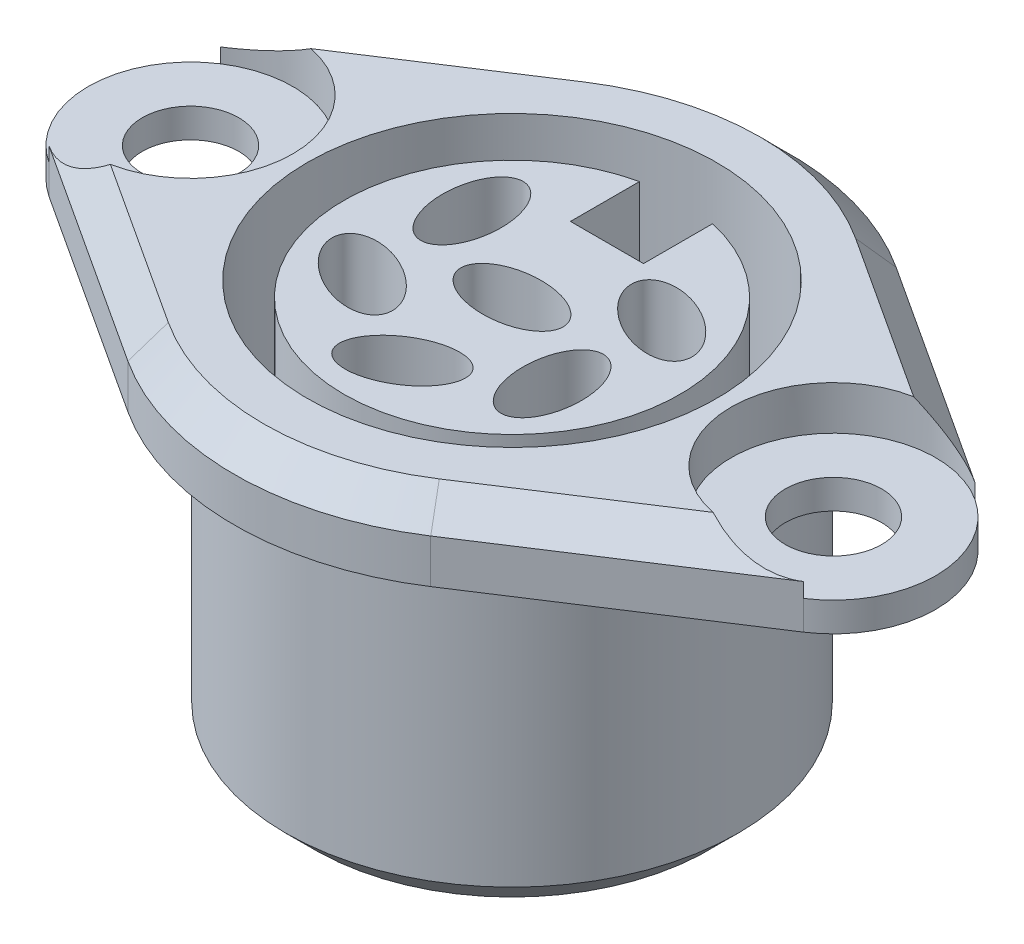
ISO-10303-21;
HEADER;
FILE_DESCRIPTION(('STEP AP214'),'2;1');
FILE_NAME('part.step','',(''),(''),'','','');
FILE_SCHEMA(('AUTOMOTIVE_DESIGN { 1 0 10303 214 1 1 1 1 }'));
ENDSEC;
DATA;
#1=APPLICATION_CONTEXT('core data for automotive mechanical design processes');
#2=APPLICATION_PROTOCOL_DEFINITION('international standard','automotive_design',2000,#1);
#3=PRODUCT_CONTEXT('',#1,'mechanical');
#4=PRODUCT('Part','Part','',(#3));
#5=PRODUCT_RELATED_PRODUCT_CATEGORY('part','',(#4));
#6=PRODUCT_DEFINITION_FORMATION('','',#4);
#7=PRODUCT_DEFINITION_CONTEXT('part definition',#1,'design');
#8=PRODUCT_DEFINITION('design','',#6,#7);
#9=PRODUCT_DEFINITION_SHAPE('','',#8);
#10=(LENGTH_UNIT() NAMED_UNIT(*) SI_UNIT(.MILLI.,.METRE.));
#11=(NAMED_UNIT(*) PLANE_ANGLE_UNIT() SI_UNIT($,.RADIAN.));
#12=(NAMED_UNIT(*) SI_UNIT($,.STERADIAN.) SOLID_ANGLE_UNIT());
#13=UNCERTAINTY_MEASURE_WITH_UNIT(LENGTH_MEASURE(1.E-05),#10,'distance_accuracy_value','');
#14=(GEOMETRIC_REPRESENTATION_CONTEXT(3) GLOBAL_UNCERTAINTY_ASSIGNED_CONTEXT((#13)) GLOBAL_UNIT_ASSIGNED_CONTEXT((#10,
#11,#12)) REPRESENTATION_CONTEXT('',''));
#15=CARTESIAN_POINT('',(0.,0.,0.));
#16=DIRECTION('',(0.,0.,1.));
#17=DIRECTION('',(1.,0.,0.));
#18=AXIS2_PLACEMENT_3D('',#15,#16,#17);
#19=CARTESIAN_POINT('',(0.,-12.,0.));
#20=DIRECTION('',(0.,-1.,0.));
#21=DIRECTION('',(1.,0.,0.));
#22=AXIS2_PLACEMENT_3D('',#19,#20,#21);
#23=PLANE('',#22);
#24=CARTESIAN_POINT('',(0.,-12.,0.));
#25=DIRECTION('',(0.,1.,0.));
#26=DIRECTION('',(-1.,0.,0.));
#27=AXIS2_PLACEMENT_3D('',#24,#25,#26);
#28=CIRCLE('',#27,6.99999999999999);
#29=CARTESIAN_POINT('',(-6.99999999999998,-12.,0.));
#30=VERTEX_POINT('',#29);
#31=EDGE_CURVE('E258',#30,#30,#28,.T.);
#32=ORIENTED_EDGE('',*,*,#31,.T.);
#33=EDGE_LOOP('',(#32));
#34=FACE_BOUND('',#33,.T.);
#35=DIRECTION('',(0.,0.,1.));
#36=VECTOR('',#35,1.);
#37=CARTESIAN_POINT('',(1.25,-12.,-5.61248608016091));
#38=LINE('',#37,#36);
#39=CARTESIAN_POINT('',(1.25,-12.,-5.61248608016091));
#40=VERTEX_POINT('',#39);
#41=CARTESIAN_POINT('',(1.25,-12.,-3.25));
#42=VERTEX_POINT('',#41);
#43=EDGE_CURVE('E43',#40,#42,#38,.T.);
#44=ORIENTED_EDGE('',*,*,#43,.F.);
#45=CARTESIAN_POINT('',(0.,-12.,0.));
#46=DIRECTION('',(0.,1.,0.));
#47=DIRECTION('',(1.,0.,0.));
#48=AXIS2_PLACEMENT_3D('',#45,#46,#47);
#49=CIRCLE('',#48,5.75);
#50=CARTESIAN_POINT('',(-1.25,-12.,-5.61248608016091));
#51=VERTEX_POINT('',#50);
#52=EDGE_CURVE('E48',#51,#40,#49,.T.);
#53=ORIENTED_EDGE('',*,*,#52,.F.);
#54=DIRECTION('',(0.,0.,-1.));
#55=VECTOR('',#54,1.);
#56=CARTESIAN_POINT('',(-1.25,-12.,-3.25));
#57=LINE('',#56,#55);
#58=CARTESIAN_POINT('',(-1.25,-12.,-3.25));
#59=VERTEX_POINT('',#58);
#60=EDGE_CURVE('E149',#59,#51,#57,.T.);
#61=ORIENTED_EDGE('',*,*,#60,.F.);
#62=DIRECTION('',(-1.,0.,0.));
#63=VECTOR('',#62,1.);
#64=CARTESIAN_POINT('',(1.25,-12.,-3.25));
#65=LINE('',#64,#63);
#66=EDGE_CURVE('E152',#42,#59,#65,.T.);
#67=ORIENTED_EDGE('',*,*,#66,.F.);
#68=EDGE_LOOP('',(#44,#53,#61,#67));
#69=FACE_BOUND('',#68,.T.);
#70=ADVANCED_FACE('F28',(#34,#69),#23,.F.);
#71=CARTESIAN_POINT('',(11.,-13.5,0.));
#72=DIRECTION('',(0.,1.,0.));
#73=DIRECTION('',(-1.,0.,0.));
#74=AXIS2_PLACEMENT_3D('',#71,#72,#73);
#75=CYLINDRICAL_SURFACE('',#74,3.5);
#76=DIRECTION('',(0.,1.,0.));
#77=VECTOR('',#76,1.);
#78=CARTESIAN_POINT('',(12.9090909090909,-13.5,-2.93349141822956));
#79=LINE('',#78,#77);
#80=CARTESIAN_POINT('',(12.9090909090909,-2.5,-2.93349141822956));
#81=VERTEX_POINT('',#80);
#82=CARTESIAN_POINT('',(12.9090909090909,-1.5,-2.93349141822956));
#83=VERTEX_POINT('',#82);
#84=EDGE_CURVE('E243',#81,#83,#79,.T.);
#85=ORIENTED_EDGE('',*,*,#84,.T.);
#86=CARTESIAN_POINT('',(11.,-1.5,0.));
#87=DIRECTION('',(0.,1.,0.));
#88=DIRECTION('',(-1.,0.,0.));
#89=AXIS2_PLACEMENT_3D('',#86,#87,#88);
#90=CIRCLE('',#89,3.5);
#91=CARTESIAN_POINT('',(12.9090909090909,-1.5,2.93349141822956));
#92=VERTEX_POINT('',#91);
#93=EDGE_CURVE('E191',#92,#83,#90,.T.);
#94=ORIENTED_EDGE('',*,*,#93,.F.);
#95=DIRECTION('',(0.,1.,0.));
#96=VECTOR('',#95,1.);
#97=CARTESIAN_POINT('',(12.9090909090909,-13.5,2.93349141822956));
#98=LINE('',#97,#96);
#99=CARTESIAN_POINT('',(12.9090909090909,-2.5,2.93349141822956));
#100=VERTEX_POINT('',#99);
#101=EDGE_CURVE('E246',#100,#92,#98,.T.);
#102=ORIENTED_EDGE('',*,*,#101,.F.);
#103=CARTESIAN_POINT('',(11.,-2.5,0.));
#104=DIRECTION('',(0.,1.,0.));
#105=DIRECTION('',(-1.,0.,0.));
#106=AXIS2_PLACEMENT_3D('',#103,#104,#105);
#107=CIRCLE('',#106,3.5);
#108=EDGE_CURVE('E263',#100,#81,#107,.T.);
#109=ORIENTED_EDGE('',*,*,#108,.T.);
#110=EDGE_LOOP('',(#85,#94,#102,#109));
#111=FACE_BOUND('',#110,.T.);
#112=ADVANCED_FACE('F343',(#111),#75,.T.);
#113=CARTESIAN_POINT('',(11.,-13.5,0.));
#114=DIRECTION('',(0.,1.,0.));
#115=DIRECTION('',(-1.,0.,0.));
#116=AXIS2_PLACEMENT_3D('',#113,#114,#115);
#117=CYLINDRICAL_SURFACE('',#116,1.65);
#118=CARTESIAN_POINT('',(11.,-2.5,0.));
#119=DIRECTION('',(0.,1.,0.));
#120=DIRECTION('',(-1.,0.,0.));
#121=AXIS2_PLACEMENT_3D('',#118,#119,#120);
#122=CIRCLE('',#121,1.65);
#123=CARTESIAN_POINT('',(9.35,-2.5,0.));
#124=VERTEX_POINT('',#123);
#125=EDGE_CURVE('E226',#124,#124,#122,.T.);
#126=ORIENTED_EDGE('',*,*,#125,.F.);
#127=EDGE_LOOP('',(#126));
#128=FACE_BOUND('',#127,.T.);
#129=CARTESIAN_POINT('',(11.,-1.5,0.));
#130=DIRECTION('',(0.,1.,0.));
#131=DIRECTION('',(-1.,0.,0.));
#132=AXIS2_PLACEMENT_3D('',#129,#130,#131);
#133=CIRCLE('',#132,1.65);
#134=CARTESIAN_POINT('',(9.35,-1.5,0.));
#135=VERTEX_POINT('',#134);
#136=EDGE_CURVE('E31',#135,#135,#133,.F.);
#137=ORIENTED_EDGE('',*,*,#136,.F.);
#138=EDGE_LOOP('',(#137));
#139=FACE_BOUND('',#138,.T.);
#140=ADVANCED_FACE('F336',(#128,#139),#117,.F.);
#141=CARTESIAN_POINT('',(-11.,-13.5,0.));
#142=DIRECTION('',(0.,1.,0.));
#143=DIRECTION('',(-1.,0.,0.));
#144=AXIS2_PLACEMENT_3D('',#141,#142,#143);
#145=CYLINDRICAL_SURFACE('',#144,3.5);
#146=DIRECTION('',(0.,1.,0.));
#147=VECTOR('',#146,1.);
#148=CARTESIAN_POINT('',(-12.9090909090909,-13.5,2.93349141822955));
#149=LINE('',#148,#147);
#150=CARTESIAN_POINT('',(-12.9090909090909,-2.50000000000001,2.93349141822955));
#151=VERTEX_POINT('',#150);
#152=CARTESIAN_POINT('',(-12.9090909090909,-1.5,2.93349141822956));
#153=VERTEX_POINT('',#152);
#154=EDGE_CURVE('E231',#151,#153,#149,.T.);
#155=ORIENTED_EDGE('',*,*,#154,.T.);
#156=CARTESIAN_POINT('',(-11.,-1.5,0.));
#157=DIRECTION('',(0.,1.,0.));
#158=DIRECTION('',(-1.,0.,0.));
#159=AXIS2_PLACEMENT_3D('',#156,#157,#158);
#160=CIRCLE('',#159,3.5);
#161=CARTESIAN_POINT('',(-12.9090909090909,-1.5,-2.93349141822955));
#162=VERTEX_POINT('',#161);
#163=EDGE_CURVE('E203',#162,#153,#160,.T.);
#164=ORIENTED_EDGE('',*,*,#163,.F.);
#165=DIRECTION('',(0.,1.,0.));
#166=VECTOR('',#165,1.);
#167=CARTESIAN_POINT('',(-12.9090909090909,-13.5,-2.93349141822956));
#168=LINE('',#167,#166);
#169=CARTESIAN_POINT('',(-12.9090909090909,-2.50000000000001,-2.93349141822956));
#170=VERTEX_POINT('',#169);
#171=EDGE_CURVE('E234',#170,#162,#168,.T.);
#172=ORIENTED_EDGE('',*,*,#171,.F.);
#173=CARTESIAN_POINT('',(-11.,-2.50000000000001,0.));
#174=DIRECTION('',(0.,1.,0.));
#175=DIRECTION('',(-1.,0.,0.));
#176=AXIS2_PLACEMENT_3D('',#173,#174,#175);
#177=CIRCLE('',#176,3.5);
#178=EDGE_CURVE('E274',#170,#151,#177,.T.);
#179=ORIENTED_EDGE('',*,*,#178,.T.);
#180=EDGE_LOOP('',(#155,#164,#172,#179));
#181=FACE_BOUND('',#180,.T.);
#182=ADVANCED_FACE('F326',(#181),#145,.T.);
#183=CARTESIAN_POINT('',(-11.,-13.5,0.));
#184=DIRECTION('',(0.,1.,0.));
#185=DIRECTION('',(-1.,0.,0.));
#186=AXIS2_PLACEMENT_3D('',#183,#184,#185);
#187=CYLINDRICAL_SURFACE('',#186,1.65);
#188=CARTESIAN_POINT('',(-11.,-2.50000000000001,0.));
#189=DIRECTION('',(0.,1.,0.));
#190=DIRECTION('',(-1.,0.,0.));
#191=AXIS2_PLACEMENT_3D('',#188,#189,#190);
#192=CIRCLE('',#191,1.65);
#193=CARTESIAN_POINT('',(-12.65,-2.50000000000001,0.));
#194=VERTEX_POINT('',#193);
#195=EDGE_CURVE('E252',#194,#194,#192,.T.);
#196=ORIENTED_EDGE('',*,*,#195,.F.);
#197=EDGE_LOOP('',(#196));
#198=FACE_BOUND('',#197,.T.);
#199=CARTESIAN_POINT('',(-11.,-1.5,0.));
#200=DIRECTION('',(0.,1.,0.));
#201=DIRECTION('',(-1.,0.,0.));
#202=AXIS2_PLACEMENT_3D('',#199,#200,#201);
#203=CIRCLE('',#202,1.65);
#204=CARTESIAN_POINT('',(-12.65,-1.5,0.));
#205=VERTEX_POINT('',#204);
#206=EDGE_CURVE('E214',#205,#205,#203,.F.);
#207=ORIENTED_EDGE('',*,*,#206,.F.);
#208=EDGE_LOOP('',(#207));
#209=FACE_BOUND('',#208,.T.);
#210=ADVANCED_FACE('F323',(#198,#209),#187,.F.);
#211=CARTESIAN_POINT('',(7.00000000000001,0.,0.));
#212=DIRECTION('',(0.,-1.,0.));
#213=DIRECTION('',(1.,0.,0.));
#214=AXIS2_PLACEMENT_3D('',#211,#212,#213);
#215=PLANE('',#214);
#216=DIRECTION('',(0.838140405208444,0.,-0.545454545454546));
#217=VECTOR('',#216,1.);
#218=CARTESIAN_POINT('',(12.3636363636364,0.,2.0953510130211));
#219=LINE('',#218,#217);
#220=CARTESIAN_POINT('',(4.63636363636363,0.,7.12419344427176));
#221=VERTEX_POINT('',#220);
#222=CARTESIAN_POINT('',(10.3106200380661,0.,3.43143632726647));
#223=VERTEX_POINT('',#222);
#224=EDGE_CURVE('E278',#221,#223,#219,.T.);
#225=ORIENTED_EDGE('',*,*,#224,.T.);
#226=CARTESIAN_POINT('',(11.,0.,0.));
#227=DIRECTION('',(0.,1.,0.));
#228=DIRECTION('',(-1.,0.,0.));
#229=AXIS2_PLACEMENT_3D('',#226,#227,#228);
#230=CIRCLE('',#229,3.5);
#231=CARTESIAN_POINT('',(10.3106200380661,0.,-3.43143632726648));
#232=VERTEX_POINT('',#231);
#233=EDGE_CURVE('E188',#232,#223,#230,.T.);
#234=ORIENTED_EDGE('',*,*,#233,.F.);
#235=DIRECTION('',(-0.838140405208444,0.,-0.545454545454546));
#236=VECTOR('',#235,1.);
#237=CARTESIAN_POINT('',(4.63636363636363,0.,-7.12419344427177));
#238=LINE('',#237,#236);
#239=CARTESIAN_POINT('',(4.63636363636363,0.,-7.12419344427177));
#240=VERTEX_POINT('',#239);
#241=EDGE_CURVE('E287',#232,#240,#238,.T.);
#242=ORIENTED_EDGE('',*,*,#241,.T.);
#243=CARTESIAN_POINT('',(0.,0.,0.));
#244=DIRECTION('',(0.,-1.,0.));
#245=DIRECTION('',(1.,0.,0.));
#246=AXIS2_PLACEMENT_3D('',#243,#244,#245);
#247=CIRCLE('',#246,8.49999999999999);
#248=CARTESIAN_POINT('',(-4.63636363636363,0.,-7.12419344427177));
#249=VERTEX_POINT('',#248);
#250=EDGE_CURVE('E291',#240,#249,#247,.F.);
#251=ORIENTED_EDGE('',*,*,#250,.T.);
#252=DIRECTION('',(-0.838140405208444,0.,0.545454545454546));
#253=VECTOR('',#252,1.);
#254=CARTESIAN_POINT('',(-12.3636363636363,0.,-2.0953510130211));
#255=LINE('',#254,#253);
#256=CARTESIAN_POINT('',(-10.3106200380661,0.,-3.43143632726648));
#257=VERTEX_POINT('',#256);
#258=EDGE_CURVE('E293',#249,#257,#255,.T.);
#259=ORIENTED_EDGE('',*,*,#258,.T.);
#260=CARTESIAN_POINT('',(-11.,0.,0.));
#261=DIRECTION('',(0.,1.,0.));
#262=DIRECTION('',(-1.,0.,0.));
#263=AXIS2_PLACEMENT_3D('',#260,#261,#262);
#264=CIRCLE('',#263,3.5);
#265=CARTESIAN_POINT('',(-10.3106200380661,0.,3.43143632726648));
#266=VERTEX_POINT('',#265);
#267=EDGE_CURVE('E201',#266,#257,#264,.T.);
#268=ORIENTED_EDGE('',*,*,#267,.F.);
#269=DIRECTION('',(0.838140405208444,0.,0.545454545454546));
#270=VECTOR('',#269,1.);
#271=CARTESIAN_POINT('',(-4.63636363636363,0.,7.12419344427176));
#272=LINE('',#271,#270);
#273=CARTESIAN_POINT('',(-4.63636363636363,0.,7.12419344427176));
#274=VERTEX_POINT('',#273);
#275=EDGE_CURVE('E289',#266,#274,#272,.T.);
#276=ORIENTED_EDGE('',*,*,#275,.T.);
#277=CARTESIAN_POINT('',(0.,0.,0.));
#278=DIRECTION('',(0.,-1.,0.));
#279=DIRECTION('',(1.,0.,0.));
#280=AXIS2_PLACEMENT_3D('',#277,#278,#279);
#281=CIRCLE('',#280,8.49999999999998);
#282=EDGE_CURVE('E285',#274,#221,#281,.F.);
#283=ORIENTED_EDGE('',*,*,#282,.T.);
#284=EDGE_LOOP('',(#225,#234,#242,#251,#259,#268,#276,#283));
#285=FACE_BOUND('',#284,.T.);
#286=CARTESIAN_POINT('',(0.,0.,0.));
#287=DIRECTION('',(0.,1.,0.));
#288=DIRECTION('',(-1.,0.,0.));
#289=AXIS2_PLACEMENT_3D('',#286,#287,#288);
#290=CIRCLE('',#289,7.);
#291=CARTESIAN_POINT('',(-6.99999999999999,0.,0.));
#292=VERTEX_POINT('',#291);
#293=EDGE_CURVE('E255',#292,#292,#290,.T.);
#294=ORIENTED_EDGE('',*,*,#293,.F.);
#295=EDGE_LOOP('',(#294));
#296=FACE_BOUND('',#295,.T.);
#297=ADVANCED_FACE('F325',(#285,#296),#215,.F.);
#298=CARTESIAN_POINT('',(0.,25.6824314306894,0.));
#299=DIRECTION('',(0.,1.,0.));
#300=DIRECTION('',(-1.,0.,0.));
#301=AXIS2_PLACEMENT_3D('',#298,#299,#300);
#302=CYLINDRICAL_SURFACE('',#301,7.);
#303=ORIENTED_EDGE('',*,*,#31,.F.);
#304=EDGE_LOOP('',(#303));
#305=FACE_BOUND('',#304,.T.);
#306=ORIENTED_EDGE('',*,*,#293,.T.);
#307=EDGE_LOOP('',(#306));
#308=FACE_BOUND('',#307,.T.);
#309=ADVANCED_FACE('F333',(#305,#308),#302,.F.);
#310=CARTESIAN_POINT('',(0.,-13.5,0.));
#311=DIRECTION('',(0.,1.,0.));
#312=DIRECTION('',(-1.,0.,0.));
#313=AXIS2_PLACEMENT_3D('',#310,#311,#312);
#314=CYLINDRICAL_SURFACE('',#313,9.5);
#315=DIRECTION('',(0.,1.,0.));
#316=VECTOR('',#315,1.);
#317=CARTESIAN_POINT('',(5.18181818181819,-13.5,7.96233384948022));
#318=LINE('',#317,#316);
#319=CARTESIAN_POINT('',(5.18181818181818,-2.5,7.96233384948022));
#320=VERTEX_POINT('',#319);
#321=CARTESIAN_POINT('',(5.18181818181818,-1.00000000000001,7.96233384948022));
#322=VERTEX_POINT('',#321);
#323=EDGE_CURVE('E249',#320,#322,#318,.T.);
#324=ORIENTED_EDGE('',*,*,#323,.T.);
#325=CARTESIAN_POINT('',(0.,-1.00000000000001,0.));
#326=DIRECTION('',(0.,-1.,0.));
#327=DIRECTION('',(1.,0.,0.));
#328=AXIS2_PLACEMENT_3D('',#325,#326,#327);
#329=CIRCLE('',#328,9.5);
#330=CARTESIAN_POINT('',(-5.18181818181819,-1.00000000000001,7.96233384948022));
#331=VERTEX_POINT('',#330);
#332=EDGE_CURVE('E307',#322,#331,#329,.T.);
#333=ORIENTED_EDGE('',*,*,#332,.T.);
#334=DIRECTION('',(0.,1.,0.));
#335=VECTOR('',#334,1.);
#336=CARTESIAN_POINT('',(-5.18181818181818,-13.5,7.96233384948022));
#337=LINE('',#336,#335);
#338=CARTESIAN_POINT('',(-5.18181818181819,-2.50000000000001,7.96233384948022));
#339=VERTEX_POINT('',#338);
#340=EDGE_CURVE('E227',#339,#331,#337,.T.);
#341=ORIENTED_EDGE('',*,*,#340,.F.);
#342=CARTESIAN_POINT('',(0.,-2.50000000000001,0.));
#343=DIRECTION('',(0.,1.,0.));
#344=DIRECTION('',(-1.,0.,0.));
#345=AXIS2_PLACEMENT_3D('',#342,#343,#344);
#346=CIRCLE('',#345,9.5);
#347=EDGE_CURVE('E265',#339,#320,#346,.T.);
#348=ORIENTED_EDGE('',*,*,#347,.T.);
#349=EDGE_LOOP('',(#324,#333,#341,#348));
#350=FACE_BOUND('',#349,.T.);
#351=ADVANCED_FACE('F354',(#350),#314,.T.);
#352=CARTESIAN_POINT('',(-5.18181818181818,-13.5,7.96233384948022));
#353=DIRECTION('',(-0.545454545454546,0.,0.838140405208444));
#354=DIRECTION('',(0.838140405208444,0.,0.545454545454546));
#355=AXIS2_PLACEMENT_3D('',#352,#353,#354);
#356=PLANE('',#355);
#357=ORIENTED_EDGE('',*,*,#340,.T.);
#358=DIRECTION('',(-0.838140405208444,0.,-0.545454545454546));
#359=VECTOR('',#358,1.);
#360=CARTESIAN_POINT('',(-12.9090909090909,-1.00000000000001,2.93349141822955));
#361=LINE('',#360,#359);
#362=CARTESIAN_POINT('',(-12.9090909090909,-1.00000000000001,2.93349141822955));
#363=VERTEX_POINT('',#362);
#364=EDGE_CURVE('E301',#331,#363,#361,.T.);
#365=ORIENTED_EDGE('',*,*,#364,.T.);
#366=DIRECTION('',(0.,1.,0.));
#367=VECTOR('',#366,1.);
#368=CARTESIAN_POINT('',(-12.9090909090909,-1.5,2.93349141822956));
#369=LINE('',#368,#367);
#370=EDGE_CURVE('E212',#153,#363,#369,.T.);
#371=ORIENTED_EDGE('',*,*,#370,.F.);
#372=ORIENTED_EDGE('',*,*,#154,.F.);
#373=DIRECTION('',(0.838140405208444,0.,0.545454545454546));
#374=VECTOR('',#373,1.);
#375=CARTESIAN_POINT('',(5.00413223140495,-2.5,14.5912625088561));
#376=LINE('',#375,#374);
#377=EDGE_CURVE('E276',#151,#339,#376,.T.);
#378=ORIENTED_EDGE('',*,*,#377,.T.);
#379=EDGE_LOOP('',(#357,#365,#371,#372,#378));
#380=FACE_BOUND('',#379,.T.);
#381=ADVANCED_FACE('F360',(#380),#356,.T.);
#382=CARTESIAN_POINT('',(-12.9090909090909,-13.5,-2.93349141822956));
#383=DIRECTION('',(-0.545454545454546,0.,-0.838140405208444));
#384=DIRECTION('',(-0.838140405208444,0.,0.545454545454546));
#385=AXIS2_PLACEMENT_3D('',#382,#383,#384);
#386=PLANE('',#385);
#387=ORIENTED_EDGE('',*,*,#171,.T.);
#388=DIRECTION('',(0.,1.,0.));
#389=VECTOR('',#388,1.);
#390=CARTESIAN_POINT('',(-12.9090909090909,-1.5,-2.93349141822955));
#391=LINE('',#390,#389);
#392=CARTESIAN_POINT('',(-12.9090909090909,-1.00000000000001,-2.93349141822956));
#393=VERTEX_POINT('',#392);
#394=EDGE_CURVE('E209',#162,#393,#391,.T.);
#395=ORIENTED_EDGE('',*,*,#394,.T.);
#396=DIRECTION('',(0.838140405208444,0.,-0.545454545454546));
#397=VECTOR('',#396,1.);
#398=CARTESIAN_POINT('',(-5.18181818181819,-1.00000000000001,-7.96233384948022));
#399=LINE('',#398,#397);
#400=CARTESIAN_POINT('',(-5.18181818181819,-1.00000000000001,-7.96233384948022));
#401=VERTEX_POINT('',#400);
#402=EDGE_CURVE('E296',#393,#401,#399,.T.);
#403=ORIENTED_EDGE('',*,*,#402,.T.);
#404=DIRECTION('',(0.,1.,0.));
#405=VECTOR('',#404,1.);
#406=CARTESIAN_POINT('',(-5.18181818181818,-13.5,-7.96233384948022));
#407=LINE('',#406,#405);
#408=CARTESIAN_POINT('',(-5.18181818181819,-2.50000000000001,-7.96233384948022));
#409=VERTEX_POINT('',#408);
#410=EDGE_CURVE('E237',#409,#401,#407,.T.);
#411=ORIENTED_EDGE('',*,*,#410,.F.);
#412=DIRECTION('',(-0.838140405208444,0.,0.545454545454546));
#413=VECTOR('',#412,1.);
#414=CARTESIAN_POINT('',(5.00413223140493,-2.5,-14.5912625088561));
#415=LINE('',#414,#413);
#416=EDGE_CURVE('E272',#409,#170,#415,.T.);
#417=ORIENTED_EDGE('',*,*,#416,.T.);
#418=EDGE_LOOP('',(#387,#395,#403,#411,#417));
#419=FACE_BOUND('',#418,.T.);
#420=ADVANCED_FACE('F388',(#419),#386,.T.);
#421=CARTESIAN_POINT('',(0.,-13.5,0.));
#422=DIRECTION('',(0.,1.,0.));
#423=DIRECTION('',(-1.,0.,0.));
#424=AXIS2_PLACEMENT_3D('',#421,#422,#423);
#425=CYLINDRICAL_SURFACE('',#424,9.50000000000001);
#426=ORIENTED_EDGE('',*,*,#410,.T.);
#427=CARTESIAN_POINT('',(0.,-1.00000000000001,0.));
#428=DIRECTION('',(0.,-1.,0.));
#429=DIRECTION('',(1.,0.,0.));
#430=AXIS2_PLACEMENT_3D('',#427,#428,#429);
#431=CIRCLE('',#430,9.50000000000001);
#432=CARTESIAN_POINT('',(5.18181818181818,-1.00000000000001,-7.96233384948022));
#433=VERTEX_POINT('',#432);
#434=EDGE_CURVE('E299',#401,#433,#431,.T.);
#435=ORIENTED_EDGE('',*,*,#434,.T.);
#436=DIRECTION('',(0.,1.,0.));
#437=VECTOR('',#436,1.);
#438=CARTESIAN_POINT('',(5.18181818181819,-13.5,-7.96233384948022));
#439=LINE('',#438,#437);
#440=CARTESIAN_POINT('',(5.18181818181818,-2.5,-7.96233384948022));
#441=VERTEX_POINT('',#440);
#442=EDGE_CURVE('E240',#441,#433,#439,.T.);
#443=ORIENTED_EDGE('',*,*,#442,.F.);
#444=CARTESIAN_POINT('',(0.,-2.50000000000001,0.));
#445=DIRECTION('',(0.,1.,0.));
#446=DIRECTION('',(-1.,0.,0.));
#447=AXIS2_PLACEMENT_3D('',#444,#445,#446);
#448=CIRCLE('',#447,9.50000000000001);
#449=EDGE_CURVE('E270',#441,#409,#448,.T.);
#450=ORIENTED_EDGE('',*,*,#449,.T.);
#451=EDGE_LOOP('',(#426,#435,#443,#450));
#452=FACE_BOUND('',#451,.T.);
#453=ADVANCED_FACE('F384',(#452),#425,.T.);
#454=CARTESIAN_POINT('',(5.18181818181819,-13.5,-7.96233384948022));
#455=DIRECTION('',(0.545454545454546,0.,-0.838140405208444));
#456=DIRECTION('',(-0.838140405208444,0.,-0.545454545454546));
#457=AXIS2_PLACEMENT_3D('',#454,#455,#456);
#458=PLANE('',#457);
#459=ORIENTED_EDGE('',*,*,#442,.T.);
#460=DIRECTION('',(0.838140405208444,0.,0.545454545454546));
#461=VECTOR('',#460,1.);
#462=CARTESIAN_POINT('',(12.9090909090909,-1.00000000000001,-2.93349141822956));
#463=LINE('',#462,#461);
#464=CARTESIAN_POINT('',(12.9090909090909,-1.00000000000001,-2.93349141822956));
#465=VERTEX_POINT('',#464);
#466=EDGE_CURVE('E304',#433,#465,#463,.T.);
#467=ORIENTED_EDGE('',*,*,#466,.T.);
#468=DIRECTION('',(0.,1.,0.));
#469=VECTOR('',#468,1.);
#470=CARTESIAN_POINT('',(12.9090909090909,-1.5,-2.93349141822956));
#471=LINE('',#470,#469);
#472=EDGE_CURVE('E199',#83,#465,#471,.T.);
#473=ORIENTED_EDGE('',*,*,#472,.F.);
#474=ORIENTED_EDGE('',*,*,#84,.F.);
#475=DIRECTION('',(-0.838140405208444,0.,-0.545454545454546));
#476=VECTOR('',#475,1.);
#477=CARTESIAN_POINT('',(15.3677685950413,-2.5,-1.33340519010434));
#478=LINE('',#477,#476);
#479=EDGE_CURVE('E268',#81,#441,#478,.T.);
#480=ORIENTED_EDGE('',*,*,#479,.T.);
#481=EDGE_LOOP('',(#459,#467,#473,#474,#480));
#482=FACE_BOUND('',#481,.T.);
#483=ADVANCED_FACE('F379',(#482),#458,.T.);
#484=CARTESIAN_POINT('',(12.9090909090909,-13.5,2.93349141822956));
#485=DIRECTION('',(0.545454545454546,0.,0.838140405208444));
#486=DIRECTION('',(0.838140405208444,0.,-0.545454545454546));
#487=AXIS2_PLACEMENT_3D('',#484,#485,#486);
#488=PLANE('',#487);
#489=ORIENTED_EDGE('',*,*,#101,.T.);
#490=DIRECTION('',(0.,1.,0.));
#491=VECTOR('',#490,1.);
#492=CARTESIAN_POINT('',(12.9090909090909,-1.5,2.93349141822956));
#493=LINE('',#492,#491);
#494=CARTESIAN_POINT('',(12.9090909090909,-1.00000000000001,2.93349141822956));
#495=VERTEX_POINT('',#494);
#496=EDGE_CURVE('E196',#92,#495,#493,.T.);
#497=ORIENTED_EDGE('',*,*,#496,.T.);
#498=DIRECTION('',(-0.838140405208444,0.,0.545454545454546));
#499=VECTOR('',#498,1.);
#500=CARTESIAN_POINT('',(5.18181818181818,-1.00000000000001,7.96233384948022));
#501=LINE('',#500,#499);
#502=EDGE_CURVE('E315',#495,#322,#501,.T.);
#503=ORIENTED_EDGE('',*,*,#502,.T.);
#504=ORIENTED_EDGE('',*,*,#323,.F.);
#505=DIRECTION('',(0.838140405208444,0.,-0.545454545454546));
#506=VECTOR('',#505,1.);
#507=CARTESIAN_POINT('',(15.3677685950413,-2.5,1.33340519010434));
#508=LINE('',#507,#506);
#509=EDGE_CURVE('E261',#320,#100,#508,.T.);
#510=ORIENTED_EDGE('',*,*,#509,.T.);
#511=EDGE_LOOP('',(#489,#497,#503,#504,#510));
#512=FACE_BOUND('',#511,.T.);
#513=ADVANCED_FACE('F375',(#512),#488,.T.);
#514=CARTESIAN_POINT('',(7.75000000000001,-13.5,0.));
#515=DIRECTION('',(0.,1.,0.));
#516=DIRECTION('',(-1.,0.,0.));
#517=AXIS2_PLACEMENT_3D('',#514,#515,#516);
#518=PLANE('',#517);
#519=CARTESIAN_POINT('',(3.24759526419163,-13.5,-1.87500000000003));
#520=DIRECTION('',(0.,1.,0.));
#521=DIRECTION('',(-0.866025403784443,0.,-0.499999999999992));
#522=AXIS2_PLACEMENT_3D('',#519,#520,#521);
#523=ELLIPSE('',#522,1.75,1.);
#524=CARTESIAN_POINT('',(1.73205080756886,-13.5,-2.75000000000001));
#525=VERTEX_POINT('',#524);
#526=EDGE_CURVE('E559',#525,#525,#523,.T.);
#527=ORIENTED_EDGE('',*,*,#526,.T.);
#528=EDGE_LOOP('',(#527));
#529=FACE_BOUND('',#528,.T.);
#530=CARTESIAN_POINT('',(3.24759526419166,-13.5,1.87499999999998));
#531=DIRECTION('',(0.,1.,0.));
#532=DIRECTION('',(0.,0.,-1.));
#533=AXIS2_PLACEMENT_3D('',#530,#531,#532);
#534=ELLIPSE('',#533,1.75,1.);
#535=CARTESIAN_POINT('',(3.24759526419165,-13.5,0.124999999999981));
#536=VERTEX_POINT('',#535);
#537=EDGE_CURVE('E552',#536,#536,#534,.T.);
#538=ORIENTED_EDGE('',*,*,#537,.T.);
#539=EDGE_LOOP('',(#538));
#540=FACE_BOUND('',#539,.T.);
#541=CARTESIAN_POINT('',(0.,-13.5,3.75));
#542=DIRECTION('',(0.,1.,0.));
#543=DIRECTION('',(0.866025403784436,0.,-0.500000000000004));
#544=AXIS2_PLACEMENT_3D('',#541,#542,#543);
#545=ELLIPSE('',#544,1.75,1.);
#546=CARTESIAN_POINT('',(1.51554445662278,-13.5,2.87499999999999));
#547=VERTEX_POINT('',#546);
#548=EDGE_CURVE('E546',#547,#547,#545,.T.);
#549=ORIENTED_EDGE('',*,*,#548,.T.);
#550=EDGE_LOOP('',(#549));
#551=FACE_BOUND('',#550,.T.);
#552=CARTESIAN_POINT('',(-3.24759526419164,-13.5,1.875));
#553=DIRECTION('',(0.,1.,0.));
#554=DIRECTION('',(0.86602540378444,0.,0.499999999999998));
#555=AXIS2_PLACEMENT_3D('',#552,#553,#554);
#556=ELLIPSE('',#555,1.75,1.);
#557=CARTESIAN_POINT('',(-1.73205080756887,-13.5,2.75));
#558=VERTEX_POINT('',#557);
#559=EDGE_CURVE('E529',#558,#558,#556,.T.);
#560=ORIENTED_EDGE('',*,*,#559,.T.);
#561=EDGE_LOOP('',(#560));
#562=FACE_BOUND('',#561,.T.);
#563=CARTESIAN_POINT('',(-3.24759526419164,-13.5,-1.875));
#564=DIRECTION('',(0.,1.,0.));
#565=DIRECTION('',(0.,0.,1.));
#566=AXIS2_PLACEMENT_3D('',#563,#564,#565);
#567=ELLIPSE('',#566,1.75,1.);
#568=CARTESIAN_POINT('',(-3.24759526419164,-13.5,-0.125000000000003));
#569=VERTEX_POINT('',#568);
#570=EDGE_CURVE('E522',#569,#569,#567,.T.);
#571=ORIENTED_EDGE('',*,*,#570,.T.);
#572=EDGE_LOOP('',(#571));
#573=FACE_BOUND('',#572,.T.);
#574=CARTESIAN_POINT('',(0.,-13.5,0.));
#575=DIRECTION('',(0.,1.,0.));
#576=DIRECTION('',(1.,0.,0.));
#577=AXIS2_PLACEMENT_3D('',#574,#575,#576);
#578=ELLIPSE('',#577,1.75,1.);
#579=CARTESIAN_POINT('',(1.75,-13.5,0.));
#580=VERTEX_POINT('',#579);
#581=EDGE_CURVE('E170',#580,#580,#578,.T.);
#582=ORIENTED_EDGE('',*,*,#581,.T.);
#583=EDGE_LOOP('',(#582));
#584=FACE_BOUND('',#583,.T.);
#585=CARTESIAN_POINT('',(0.,-13.5,0.));
#586=DIRECTION('',(0.,1.,0.));
#587=DIRECTION('',(-1.,0.,0.));
#588=AXIS2_PLACEMENT_3D('',#585,#586,#587);
#589=CIRCLE('',#588,6.74999999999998);
#590=CARTESIAN_POINT('',(-6.74999999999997,-13.5,0.));
#591=VERTEX_POINT('',#590);
#592=EDGE_CURVE('E312',#591,#591,#589,.F.);
#593=ORIENTED_EDGE('',*,*,#592,.T.);
#594=EDGE_LOOP('',(#593));
#595=FACE_BOUND('',#594,.T.);
#596=ADVANCED_FACE('F372',(#529,#540,#551,#562,#573,#584,#595),#518,.F.);
#597=CARTESIAN_POINT('',(0.,25.6824314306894,0.));
#598=DIRECTION('',(0.,1.,0.));
#599=DIRECTION('',(-1.,0.,0.));
#600=AXIS2_PLACEMENT_3D('',#597,#598,#599);
#601=CYLINDRICAL_SURFACE('',#600,7.74999999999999);
#602=CARTESIAN_POINT('',(0.,-12.5,0.));
#603=DIRECTION('',(0.,1.,0.));
#604=DIRECTION('',(-1.,0.,0.));
#605=AXIS2_PLACEMENT_3D('',#602,#603,#604);
#606=CIRCLE('',#605,7.74999999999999);
#607=CARTESIAN_POINT('',(-7.74999999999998,-12.5,0.));
#608=VERTEX_POINT('',#607);
#609=EDGE_CURVE('E309',#608,#608,#606,.T.);
#610=ORIENTED_EDGE('',*,*,#609,.T.);
#611=EDGE_LOOP('',(#610));
#612=FACE_BOUND('',#611,.T.);
#613=CARTESIAN_POINT('',(0.,-2.50000000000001,0.));
#614=DIRECTION('',(0.,1.,0.));
#615=DIRECTION('',(-1.,0.,0.));
#616=AXIS2_PLACEMENT_3D('',#613,#614,#615);
#617=CIRCLE('',#616,7.75);
#618=CARTESIAN_POINT('',(-7.74999999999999,-2.50000000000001,0.));
#619=VERTEX_POINT('',#618);
#620=EDGE_CURVE('E230',#619,#619,#617,.T.);
#621=ORIENTED_EDGE('',*,*,#620,.F.);
#622=EDGE_LOOP('',(#621));
#623=FACE_BOUND('',#622,.T.);
#624=ADVANCED_FACE('F368',(#612,#623),#601,.T.);
#625=CARTESIAN_POINT('',(14.5,-2.5,0.));
#626=DIRECTION('',(0.,1.,0.));
#627=DIRECTION('',(-1.,0.,0.));
#628=AXIS2_PLACEMENT_3D('',#625,#626,#627);
#629=PLANE('',#628);
#630=ORIENTED_EDGE('',*,*,#125,.T.);
#631=EDGE_LOOP('',(#630));
#632=FACE_BOUND('',#631,.T.);
#633=ORIENTED_EDGE('',*,*,#195,.T.);
#634=EDGE_LOOP('',(#633));
#635=FACE_BOUND('',#634,.T.);
#636=ORIENTED_EDGE('',*,*,#620,.T.);
#637=EDGE_LOOP('',(#636));
#638=FACE_BOUND('',#637,.T.);
#639=ORIENTED_EDGE('',*,*,#377,.F.);
#640=ORIENTED_EDGE('',*,*,#178,.F.);
#641=ORIENTED_EDGE('',*,*,#416,.F.);
#642=ORIENTED_EDGE('',*,*,#449,.F.);
#643=ORIENTED_EDGE('',*,*,#479,.F.);
#644=ORIENTED_EDGE('',*,*,#108,.F.);
#645=ORIENTED_EDGE('',*,*,#509,.F.);
#646=ORIENTED_EDGE('',*,*,#347,.F.);
#647=EDGE_LOOP('',(#639,#640,#641,#642,#643,#644,#645,#646));
#648=FACE_BOUND('',#647,.T.);
#649=ADVANCED_FACE('F364',(#632,#635,#638,#648),#629,.F.);
#650=CARTESIAN_POINT('',(9.55371900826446,0.,3.92402098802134));
#651=DIRECTION('',(0.385694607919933,0.707106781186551,0.592654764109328));
#652=DIRECTION('',(0.,-0.642356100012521,0.766406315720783));
#653=AXIS2_PLACEMENT_3D('',#650,#651,#652);
#654=PLANE('',#653);
#655=CARTESIAN_POINT('',(11.,2.49999999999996,0.));
#656=DIRECTION('',(0.385694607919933,0.707106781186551,0.592654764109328));
#657=DIRECTION('',(-0.385694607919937,0.707106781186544,-0.592654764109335));
#658=AXIS2_PLACEMENT_3D('',#655,#656,#657);
#659=ELLIPSE('',#658,4.94974746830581,3.5);
#660=EDGE_CURVE('E194',#223,#495,#659,.T.);
#661=ORIENTED_EDGE('',*,*,#660,.F.);
#662=ORIENTED_EDGE('',*,*,#224,.F.);
#663=DIRECTION('',(-0.385694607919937,0.707106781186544,-0.592654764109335));
#664=VECTOR('',#663,1.);
#665=CARTESIAN_POINT('',(5.18181818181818,-1.00000000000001,7.96233384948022));
#666=LINE('',#665,#664);
#667=EDGE_CURVE('E223',#322,#221,#666,.T.);
#668=ORIENTED_EDGE('',*,*,#667,.F.);
#669=ORIENTED_EDGE('',*,*,#502,.F.);
#670=EDGE_LOOP('',(#661,#662,#668,#669));
#671=FACE_BOUND('',#670,.T.);
#672=ADVANCED_FACE('F367',(#671),#654,.T.);
#673=CARTESIAN_POINT('',(0.,0.,0.));
#674=DIRECTION('',(0.,-1.,0.));
#675=DIRECTION('',(1.,0.,0.));
#676=AXIS2_PLACEMENT_3D('',#673,#674,#675);
#677=CONICAL_SURFACE('',#676,8.49999999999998,0.785398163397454);
#678=ORIENTED_EDGE('',*,*,#667,.T.);
#679=ORIENTED_EDGE('',*,*,#282,.F.);
#680=DIRECTION('',(0.385694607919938,0.707106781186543,-0.592654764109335));
#681=VECTOR('',#680,1.);
#682=CARTESIAN_POINT('',(-5.18181818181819,-1.00000000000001,7.96233384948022));
#683=LINE('',#682,#681);
#684=EDGE_CURVE('E220',#331,#274,#683,.T.);
#685=ORIENTED_EDGE('',*,*,#684,.F.);
#686=ORIENTED_EDGE('',*,*,#332,.F.);
#687=EDGE_LOOP('',(#678,#679,#685,#686));
#688=FACE_BOUND('',#687,.T.);
#689=ADVANCED_FACE('F406',(#688),#677,.T.);
#690=CARTESIAN_POINT('',(9.55371900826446,0.,-3.92402098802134));
#691=DIRECTION('',(0.385694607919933,0.707106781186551,-0.592654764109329));
#692=DIRECTION('',(0.,0.642356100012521,0.766406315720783));
#693=AXIS2_PLACEMENT_3D('',#690,#691,#692);
#694=PLANE('',#693);
#695=CARTESIAN_POINT('',(11.,2.49999999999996,0.));
#696=DIRECTION('',(0.385694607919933,0.707106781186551,-0.592654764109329));
#697=DIRECTION('',(-0.385694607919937,0.707106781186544,0.592654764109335));
#698=AXIS2_PLACEMENT_3D('',#695,#696,#697);
#699=ELLIPSE('',#698,4.94974746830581,3.5);
#700=EDGE_CURVE('E11',#465,#232,#699,.T.);
#701=ORIENTED_EDGE('',*,*,#700,.F.);
#702=ORIENTED_EDGE('',*,*,#466,.F.);
#703=DIRECTION('',(0.385694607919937,-0.707106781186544,-0.592654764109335));
#704=VECTOR('',#703,1.);
#705=CARTESIAN_POINT('',(4.63636363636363,0.,-7.12419344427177));
#706=LINE('',#705,#704);
#707=EDGE_CURVE('E217',#240,#433,#706,.T.);
#708=ORIENTED_EDGE('',*,*,#707,.F.);
#709=ORIENTED_EDGE('',*,*,#241,.F.);
#710=EDGE_LOOP('',(#701,#702,#708,#709));
#711=FACE_BOUND('',#710,.T.);
#712=ADVANCED_FACE('F443',(#711),#694,.T.);
#713=CARTESIAN_POINT('',(0.280991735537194,0.,10.3243659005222));
#714=DIRECTION('',(-0.385694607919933,0.707106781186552,0.592654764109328));
#715=DIRECTION('',(0.,-0.64235610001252,0.766406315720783));
#716=AXIS2_PLACEMENT_3D('',#713,#714,#715);
#717=PLANE('',#716);
#718=CARTESIAN_POINT('',(-11.,2.49999999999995,0.));
#719=DIRECTION('',(-0.385694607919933,0.707106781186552,0.592654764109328));
#720=DIRECTION('',(0.385694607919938,0.707106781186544,-0.592654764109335));
#721=AXIS2_PLACEMENT_3D('',#718,#719,#720);
#722=ELLIPSE('',#721,4.94974746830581,3.5);
#723=EDGE_CURVE('E207',#363,#266,#722,.T.);
#724=ORIENTED_EDGE('',*,*,#723,.F.);
#725=ORIENTED_EDGE('',*,*,#364,.F.);
#726=ORIENTED_EDGE('',*,*,#684,.T.);
#727=ORIENTED_EDGE('',*,*,#275,.F.);
#728=EDGE_LOOP('',(#724,#725,#726,#727));
#729=FACE_BOUND('',#728,.T.);
#730=ADVANCED_FACE('F410',(#729),#717,.T.);
#731=CARTESIAN_POINT('',(0.,0.,0.));
#732=DIRECTION('',(0.,-1.,0.));
#733=DIRECTION('',(1.,0.,0.));
#734=AXIS2_PLACEMENT_3D('',#731,#732,#733);
#735=CONICAL_SURFACE('',#734,8.49999999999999,0.785398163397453);
#736=ORIENTED_EDGE('',*,*,#707,.T.);
#737=ORIENTED_EDGE('',*,*,#434,.F.);
#738=DIRECTION('',(-0.385694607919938,-0.707106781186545,-0.592654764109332));
#739=VECTOR('',#738,1.);
#740=CARTESIAN_POINT('',(-4.63636363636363,0.,-7.12419344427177));
#741=LINE('',#740,#739);
#742=EDGE_CURVE('E215',#249,#401,#741,.T.);
#743=ORIENTED_EDGE('',*,*,#742,.F.);
#744=ORIENTED_EDGE('',*,*,#250,.F.);
#745=EDGE_LOOP('',(#736,#737,#743,#744));
#746=FACE_BOUND('',#745,.T.);
#747=ADVANCED_FACE('F446',(#746),#735,.T.);
#748=CARTESIAN_POINT('',(0.280991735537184,0.,-10.3243659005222));
#749=DIRECTION('',(-0.385694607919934,0.707106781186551,-0.592654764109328));
#750=DIRECTION('',(0.,0.642356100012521,0.766406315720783));
#751=AXIS2_PLACEMENT_3D('',#748,#749,#750);
#752=PLANE('',#751);
#753=CARTESIAN_POINT('',(-11.,2.49999999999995,0.));
#754=DIRECTION('',(-0.385694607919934,0.707106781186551,-0.592654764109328));
#755=DIRECTION('',(0.385694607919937,0.707106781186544,0.592654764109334));
#756=AXIS2_PLACEMENT_3D('',#753,#754,#755);
#757=ELLIPSE('',#756,4.94974746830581,3.5);
#758=EDGE_CURVE('E36',#257,#393,#757,.T.);
#759=ORIENTED_EDGE('',*,*,#758,.F.);
#760=ORIENTED_EDGE('',*,*,#258,.F.);
#761=ORIENTED_EDGE('',*,*,#742,.T.);
#762=ORIENTED_EDGE('',*,*,#402,.F.);
#763=EDGE_LOOP('',(#759,#760,#761,#762));
#764=FACE_BOUND('',#763,.T.);
#765=ADVANCED_FACE('F420',(#764),#752,.T.);
#766=CARTESIAN_POINT('',(0.,-12.5,0.));
#767=DIRECTION('',(0.,1.,0.));
#768=DIRECTION('',(-1.,0.,0.));
#769=AXIS2_PLACEMENT_3D('',#766,#767,#768);
#770=CONICAL_SURFACE('',#769,7.74999999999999,0.785398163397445);
#771=ORIENTED_EDGE('',*,*,#592,.F.);
#772=EDGE_LOOP('',(#771));
#773=FACE_BOUND('',#772,.T.);
#774=ORIENTED_EDGE('',*,*,#609,.F.);
#775=EDGE_LOOP('',(#774));
#776=FACE_BOUND('',#775,.T.);
#777=ADVANCED_FACE('F481',(#773,#776),#770,.T.);
#778=CARTESIAN_POINT('',(-11.,-1.5,0.));
#779=DIRECTION('',(0.,1.,0.));
#780=DIRECTION('',(-1.,0.,0.));
#781=AXIS2_PLACEMENT_3D('',#778,#779,#780);
#782=PLANE('',#781);
#783=EDGE_CURVE('E204',#153,#162,#160,.T.);
#784=ORIENTED_EDGE('',*,*,#783,.T.);
#785=ORIENTED_EDGE('',*,*,#163,.T.);
#786=EDGE_LOOP('',(#784,#785));
#787=FACE_BOUND('',#786,.T.);
#788=ORIENTED_EDGE('',*,*,#206,.T.);
#789=EDGE_LOOP('',(#788));
#790=FACE_BOUND('',#789,.T.);
#791=ADVANCED_FACE('F321',(#787,#790),#782,.T.);
#792=CARTESIAN_POINT('',(-11.,-1.5,0.));
#793=DIRECTION('',(0.,1.,0.));
#794=DIRECTION('',(-1.,0.,0.));
#795=AXIS2_PLACEMENT_3D('',#792,#793,#794);
#796=CYLINDRICAL_SURFACE('',#795,3.5);
#797=ORIENTED_EDGE('',*,*,#370,.T.);
#798=ORIENTED_EDGE('',*,*,#723,.T.);
#799=ORIENTED_EDGE('',*,*,#267,.T.);
#800=ORIENTED_EDGE('',*,*,#758,.T.);
#801=ORIENTED_EDGE('',*,*,#394,.F.);
#802=ORIENTED_EDGE('',*,*,#783,.F.);
#803=EDGE_LOOP('',(#797,#798,#799,#800,#801,#802));
#804=FACE_BOUND('',#803,.T.);
#805=ADVANCED_FACE('F413',(#804),#796,.F.);
#806=CARTESIAN_POINT('',(11.,-1.5,0.));
#807=DIRECTION('',(0.,1.,0.));
#808=DIRECTION('',(-1.,0.,0.));
#809=AXIS2_PLACEMENT_3D('',#806,#807,#808);
#810=PLANE('',#809);
#811=ORIENTED_EDGE('',*,*,#93,.T.);
#812=EDGE_CURVE('E190',#83,#92,#90,.T.);
#813=ORIENTED_EDGE('',*,*,#812,.T.);
#814=EDGE_LOOP('',(#811,#813));
#815=FACE_BOUND('',#814,.T.);
#816=ORIENTED_EDGE('',*,*,#136,.T.);
#817=EDGE_LOOP('',(#816));
#818=FACE_BOUND('',#817,.T.);
#819=ADVANCED_FACE('F456',(#815,#818),#810,.T.);
#820=CARTESIAN_POINT('',(11.,-1.5,0.));
#821=DIRECTION('',(0.,1.,0.));
#822=DIRECTION('',(-1.,0.,0.));
#823=AXIS2_PLACEMENT_3D('',#820,#821,#822);
#824=CYLINDRICAL_SURFACE('',#823,3.5);
#825=ORIENTED_EDGE('',*,*,#472,.T.);
#826=ORIENTED_EDGE('',*,*,#700,.T.);
#827=ORIENTED_EDGE('',*,*,#233,.T.);
#828=ORIENTED_EDGE('',*,*,#660,.T.);
#829=ORIENTED_EDGE('',*,*,#496,.F.);
#830=ORIENTED_EDGE('',*,*,#812,.F.);
#831=EDGE_LOOP('',(#825,#826,#827,#828,#829,#830));
#832=FACE_BOUND('',#831,.T.);
#833=ADVANCED_FACE('F454',(#832),#824,.F.);
#834=CARTESIAN_POINT('',(1.24999999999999,16.1665113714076,-5.61248608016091));
#835=DIRECTION('',(1.,0.,0.));
#836=DIRECTION('',(0.,1.,0.));
#837=AXIS2_PLACEMENT_3D('',#834,#835,#836);
#838=PLANE('',#837);
#839=DIRECTION('',(0.,-1.,0.));
#840=VECTOR('',#839,1.);
#841=CARTESIAN_POINT('',(1.24999999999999,16.1665113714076,-3.25));
#842=LINE('',#841,#840);
#843=CARTESIAN_POINT('',(1.25,-0.500000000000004,-3.25));
#844=VERTEX_POINT('',#843);
#845=EDGE_CURVE('E169',#844,#42,#842,.T.);
#846=ORIENTED_EDGE('',*,*,#845,.F.);
#847=DIRECTION('',(0.,0.,-1.));
#848=VECTOR('',#847,1.);
#849=CARTESIAN_POINT('',(1.25,-0.500000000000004,-5.61248608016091));
#850=LINE('',#849,#848);
#851=CARTESIAN_POINT('',(1.25,-0.499999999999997,-5.61248608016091));
#852=VERTEX_POINT('',#851);
#853=EDGE_CURVE('E164',#844,#852,#850,.T.);
#854=ORIENTED_EDGE('',*,*,#853,.T.);
#855=DIRECTION('',(0.,-1.,0.));
#856=VECTOR('',#855,1.);
#857=CARTESIAN_POINT('',(1.24999999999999,16.1665113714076,-5.61248608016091));
#858=LINE('',#857,#856);
#859=EDGE_CURVE('E182',#852,#40,#858,.T.);
#860=ORIENTED_EDGE('',*,*,#859,.T.);
#861=ORIENTED_EDGE('',*,*,#43,.T.);
#862=EDGE_LOOP('',(#846,#854,#860,#861));
#863=FACE_BOUND('',#862,.T.);
#864=ADVANCED_FACE('F491',(#863),#838,.F.);
#865=CARTESIAN_POINT('',(0.,16.1665113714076,0.));
#866=DIRECTION('',(0.,-1.,0.));
#867=DIRECTION('',(1.,0.,0.));
#868=AXIS2_PLACEMENT_3D('',#865,#866,#867);
#869=CYLINDRICAL_SURFACE('',#868,5.75);
#870=ORIENTED_EDGE('',*,*,#859,.F.);
#871=CARTESIAN_POINT('',(0.,-0.500000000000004,0.));
#872=DIRECTION('',(0.,-1.,0.));
#873=DIRECTION('',(1.,0.,0.));
#874=AXIS2_PLACEMENT_3D('',#871,#872,#873);
#875=CIRCLE('',#874,5.75);
#876=CARTESIAN_POINT('',(-1.25,-0.500000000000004,-5.61248608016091));
#877=VERTEX_POINT('',#876);
#878=EDGE_CURVE('E187',#852,#877,#875,.T.);
#879=ORIENTED_EDGE('',*,*,#878,.T.);
#880=DIRECTION('',(0.,-1.,0.));
#881=VECTOR('',#880,1.);
#882=CARTESIAN_POINT('',(-1.25000000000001,16.1665113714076,-5.61248608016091));
#883=LINE('',#882,#881);
#884=EDGE_CURVE('E165',#877,#51,#883,.T.);
#885=ORIENTED_EDGE('',*,*,#884,.T.);
#886=ORIENTED_EDGE('',*,*,#52,.T.);
#887=EDGE_LOOP('',(#870,#879,#885,#886));
#888=FACE_BOUND('',#887,.T.);
#889=ADVANCED_FACE('F498',(#888),#869,.T.);
#890=CARTESIAN_POINT('',(-1.25000000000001,16.1665113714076,-3.25));
#891=DIRECTION('',(-1.,0.,0.));
#892=DIRECTION('',(0.,-1.,0.));
#893=AXIS2_PLACEMENT_3D('',#890,#891,#892);
#894=PLANE('',#893);
#895=ORIENTED_EDGE('',*,*,#884,.F.);
#896=DIRECTION('',(0.,0.,1.));
#897=VECTOR('',#896,1.);
#898=CARTESIAN_POINT('',(-1.25,-0.500000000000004,-3.25));
#899=LINE('',#898,#897);
#900=CARTESIAN_POINT('',(-1.25,-0.500000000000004,-3.25));
#901=VERTEX_POINT('',#900);
#902=EDGE_CURVE('E161',#877,#901,#899,.T.);
#903=ORIENTED_EDGE('',*,*,#902,.T.);
#904=DIRECTION('',(0.,-1.,0.));
#905=VECTOR('',#904,1.);
#906=CARTESIAN_POINT('',(-1.25000000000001,16.1665113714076,-3.25));
#907=LINE('',#906,#905);
#908=EDGE_CURVE('E159',#901,#59,#907,.T.);
#909=ORIENTED_EDGE('',*,*,#908,.T.);
#910=ORIENTED_EDGE('',*,*,#60,.T.);
#911=EDGE_LOOP('',(#895,#903,#909,#910));
#912=FACE_BOUND('',#911,.T.);
#913=ADVANCED_FACE('F160',(#912),#894,.F.);
#914=CARTESIAN_POINT('',(1.24999999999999,16.1665113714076,-3.25));
#915=DIRECTION('',(0.,0.,1.));
#916=DIRECTION('',(1.,0.,0.));
#917=AXIS2_PLACEMENT_3D('',#914,#915,#916);
#918=PLANE('',#917);
#919=ORIENTED_EDGE('',*,*,#908,.F.);
#920=DIRECTION('',(1.,0.,0.));
#921=VECTOR('',#920,1.);
#922=CARTESIAN_POINT('',(1.25,-0.500000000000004,-3.25));
#923=LINE('',#922,#921);
#924=EDGE_CURVE('E176',#901,#844,#923,.T.);
#925=ORIENTED_EDGE('',*,*,#924,.T.);
#926=ORIENTED_EDGE('',*,*,#845,.T.);
#927=ORIENTED_EDGE('',*,*,#66,.T.);
#928=EDGE_LOOP('',(#919,#925,#926,#927));
#929=FACE_BOUND('',#928,.T.);
#930=ADVANCED_FACE('F167',(#929),#918,.F.);
#931=CARTESIAN_POINT('',(7.00000000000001,-0.5,0.));
#932=DIRECTION('',(0.,-1.,0.));
#933=DIRECTION('',(1.,0.,0.));
#934=AXIS2_PLACEMENT_3D('',#931,#932,#933);
#935=PLANE('',#934);
#936=CARTESIAN_POINT('',(3.24759526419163,-0.500000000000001,-1.87500000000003));
#937=DIRECTION('',(0.,1.,0.));
#938=DIRECTION('',(-0.866025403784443,0.,-0.499999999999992));
#939=AXIS2_PLACEMENT_3D('',#936,#937,#938);
#940=ELLIPSE('',#939,1.75,1.);
#941=CARTESIAN_POINT('',(1.73205080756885,-0.500000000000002,-2.75000000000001));
#942=VERTEX_POINT('',#941);
#943=EDGE_CURVE('E563',#942,#942,#940,.T.);
#944=ORIENTED_EDGE('',*,*,#943,.F.);
#945=EDGE_LOOP('',(#944));
#946=FACE_BOUND('',#945,.T.);
#947=CARTESIAN_POINT('',(3.24759526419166,-0.500000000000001,1.87499999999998));
#948=DIRECTION('',(0.,1.,0.));
#949=DIRECTION('',(0.,0.,-1.));
#950=AXIS2_PLACEMENT_3D('',#947,#948,#949);
#951=ELLIPSE('',#950,1.75,1.);
#952=CARTESIAN_POINT('',(3.24759526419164,-0.500000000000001,0.124999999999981));
#953=VERTEX_POINT('',#952);
#954=EDGE_CURVE('E556',#953,#953,#951,.T.);
#955=ORIENTED_EDGE('',*,*,#954,.F.);
#956=EDGE_LOOP('',(#955));
#957=FACE_BOUND('',#956,.T.);
#958=CARTESIAN_POINT('',(0.,-0.500000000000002,3.75));
#959=DIRECTION('',(0.,1.,0.));
#960=DIRECTION('',(0.866025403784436,0.,-0.500000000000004));
#961=AXIS2_PLACEMENT_3D('',#958,#959,#960);
#962=ELLIPSE('',#961,1.75,1.);
#963=CARTESIAN_POINT('',(1.51554445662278,-0.500000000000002,2.87499999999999));
#964=VERTEX_POINT('',#963);
#965=EDGE_CURVE('E550',#964,#964,#962,.T.);
#966=ORIENTED_EDGE('',*,*,#965,.F.);
#967=EDGE_LOOP('',(#966));
#968=FACE_BOUND('',#967,.T.);
#969=CARTESIAN_POINT('',(-3.24759526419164,-0.500000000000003,1.875));
#970=DIRECTION('',(0.,1.,0.));
#971=DIRECTION('',(0.86602540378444,0.,0.499999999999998));
#972=AXIS2_PLACEMENT_3D('',#969,#970,#971);
#973=ELLIPSE('',#972,1.75,1.);
#974=CARTESIAN_POINT('',(-1.73205080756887,-0.500000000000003,2.75));
#975=VERTEX_POINT('',#974);
#976=EDGE_CURVE('E533',#975,#975,#973,.T.);
#977=ORIENTED_EDGE('',*,*,#976,.F.);
#978=EDGE_LOOP('',(#977));
#979=FACE_BOUND('',#978,.T.);
#980=CARTESIAN_POINT('',(-3.24759526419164,-0.500000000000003,-1.875));
#981=DIRECTION('',(0.,1.,0.));
#982=DIRECTION('',(0.,0.,1.));
#983=AXIS2_PLACEMENT_3D('',#980,#981,#982);
#984=ELLIPSE('',#983,1.75,1.);
#985=CARTESIAN_POINT('',(-3.24759526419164,-0.500000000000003,-0.125000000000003));
#986=VERTEX_POINT('',#985);
#987=EDGE_CURVE('E526',#986,#986,#984,.T.);
#988=ORIENTED_EDGE('',*,*,#987,.F.);
#989=EDGE_LOOP('',(#988));
#990=FACE_BOUND('',#989,.T.);
#991=CARTESIAN_POINT('',(0.,-0.500000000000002,0.));
#992=DIRECTION('',(0.,1.,0.));
#993=DIRECTION('',(1.,0.,0.));
#994=AXIS2_PLACEMENT_3D('',#991,#992,#993);
#995=ELLIPSE('',#994,1.75,1.);
#996=CARTESIAN_POINT('',(1.75,-0.500000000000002,0.));
#997=VERTEX_POINT('',#996);
#998=EDGE_CURVE('E173',#997,#997,#995,.T.);
#999=ORIENTED_EDGE('',*,*,#998,.F.);
#1000=EDGE_LOOP('',(#999));
#1001=FACE_BOUND('',#1000,.T.);
#1002=ORIENTED_EDGE('',*,*,#902,.F.);
#1003=ORIENTED_EDGE('',*,*,#878,.F.);
#1004=ORIENTED_EDGE('',*,*,#853,.F.);
#1005=ORIENTED_EDGE('',*,*,#924,.F.);
#1006=EDGE_LOOP('',(#1002,#1003,#1004,#1005));
#1007=FACE_BOUND('',#1006,.T.);
#1008=ADVANCED_FACE('F495',(#946,#957,#968,#979,#990,#1001,#1007),#935,.F.);
#1009=DIRECTION('',(0.,1.,0.));
#1010=VECTOR('',#1009,1.);
#1011=SURFACE_OF_LINEAR_EXTRUSION('',#578,#1010);
#1012=ORIENTED_EDGE('',*,*,#581,.F.);
#1013=EDGE_LOOP('',(#1012));
#1014=FACE_BOUND('',#1013,.T.);
#1015=ORIENTED_EDGE('',*,*,#998,.T.);
#1016=EDGE_LOOP('',(#1015));
#1017=FACE_BOUND('',#1016,.T.);
#1018=ADVANCED_FACE('F507',(#1014,#1017),#1011,.F.);
#1019=DIRECTION('',(0.,1.,0.));
#1020=VECTOR('',#1019,1.);
#1021=SURFACE_OF_LINEAR_EXTRUSION('',#567,#1020);
#1022=ORIENTED_EDGE('',*,*,#570,.F.);
#1023=EDGE_LOOP('',(#1022));
#1024=FACE_BOUND('',#1023,.T.);
#1025=ORIENTED_EDGE('',*,*,#987,.T.);
#1026=EDGE_LOOP('',(#1025));
#1027=FACE_BOUND('',#1026,.T.);
#1028=ADVANCED_FACE('F511',(#1024,#1027),#1021,.F.);
#1029=DIRECTION('',(0.,1.,0.));
#1030=VECTOR('',#1029,1.);
#1031=SURFACE_OF_LINEAR_EXTRUSION('',#556,#1030);
#1032=ORIENTED_EDGE('',*,*,#559,.F.);
#1033=EDGE_LOOP('',(#1032));
#1034=FACE_BOUND('',#1033,.T.);
#1035=ORIENTED_EDGE('',*,*,#976,.T.);
#1036=EDGE_LOOP('',(#1035));
#1037=FACE_BOUND('',#1036,.T.);
#1038=ADVANCED_FACE('F535',(#1034,#1037),#1031,.F.);
#1039=DIRECTION('',(0.,1.,0.));
#1040=VECTOR('',#1039,1.);
#1041=SURFACE_OF_LINEAR_EXTRUSION('',#545,#1040);
#1042=ORIENTED_EDGE('',*,*,#548,.F.);
#1043=EDGE_LOOP('',(#1042));
#1044=FACE_BOUND('',#1043,.T.);
#1045=ORIENTED_EDGE('',*,*,#965,.T.);
#1046=EDGE_LOOP('',(#1045));
#1047=FACE_BOUND('',#1046,.T.);
#1048=ADVANCED_FACE('F538',(#1044,#1047),#1041,.F.);
#1049=DIRECTION('',(0.,1.,0.));
#1050=VECTOR('',#1049,1.);
#1051=SURFACE_OF_LINEAR_EXTRUSION('',#534,#1050);
#1052=ORIENTED_EDGE('',*,*,#537,.F.);
#1053=EDGE_LOOP('',(#1052));
#1054=FACE_BOUND('',#1053,.T.);
#1055=ORIENTED_EDGE('',*,*,#954,.T.);
#1056=EDGE_LOOP('',(#1055));
#1057=FACE_BOUND('',#1056,.T.);
#1058=ADVANCED_FACE('F542',(#1054,#1057),#1051,.F.);
#1059=DIRECTION('',(0.,1.,0.));
#1060=VECTOR('',#1059,1.);
#1061=SURFACE_OF_LINEAR_EXTRUSION('',#523,#1060);
#1062=ORIENTED_EDGE('',*,*,#526,.F.);
#1063=EDGE_LOOP('',(#1062));
#1064=FACE_BOUND('',#1063,.T.);
#1065=ORIENTED_EDGE('',*,*,#943,.T.);
#1066=EDGE_LOOP('',(#1065));
#1067=FACE_BOUND('',#1066,.T.);
#1068=ADVANCED_FACE('F564',(#1064,#1067),#1061,.F.);
#1069=CLOSED_SHELL('',(#70,#112,#140,#182,#210,#297,#309,#351,#381,#420,#453,#483,#513,#596,
#624,#649,#672,#689,#712,#730,#747,#765,#777,#791,#805,#819,#833,#864,#889,#913,#930,#1008,
#1018,#1028,#1038,#1048,#1058,#1068));
#1070=MANIFOLD_SOLID_BREP('B2',#1069);
#1071=ADVANCED_BREP_SHAPE_REPRESENTATION('',(#18,#1070),#14);
#1072=SHAPE_DEFINITION_REPRESENTATION(#9,#1071);
ENDSEC;
END-ISO-10303-21;
